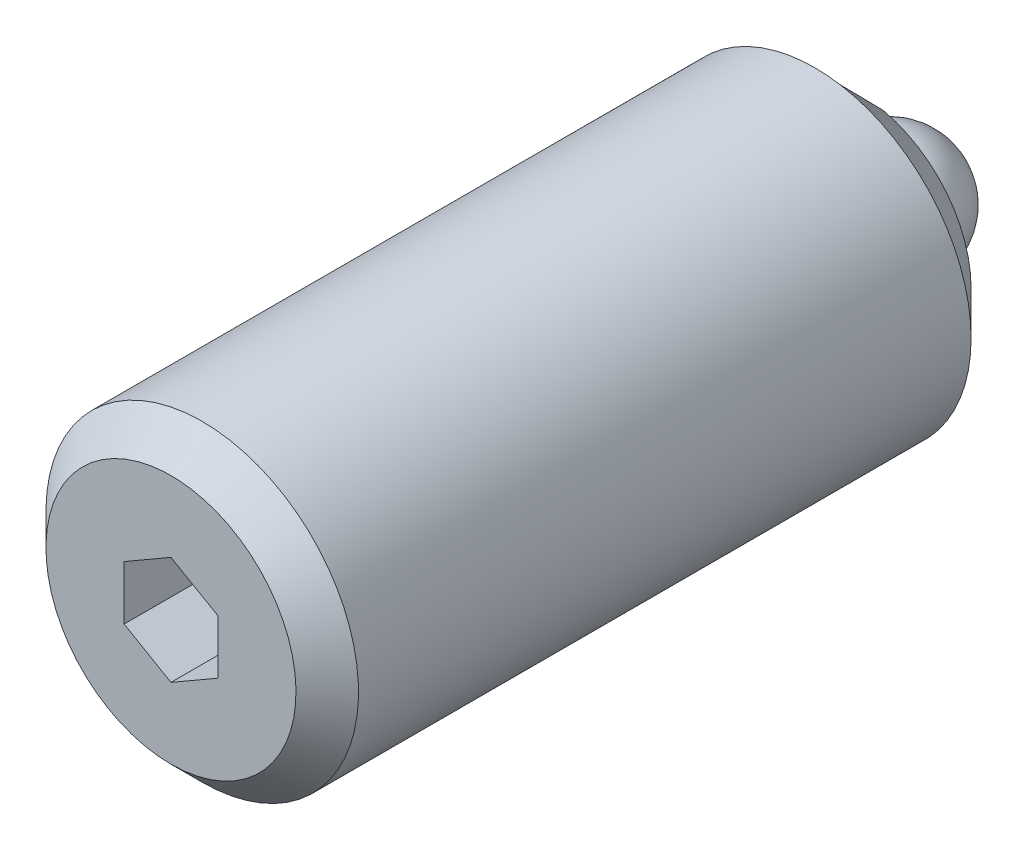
ISO-10303-21;
HEADER;
FILE_DESCRIPTION(('STEP AP214'),'2;1');
FILE_NAME('part.step','',(''),(''),'','','');
FILE_SCHEMA(('AUTOMOTIVE_DESIGN { 1 0 10303 214 1 1 1 1 }'));
ENDSEC;
DATA;
#1=APPLICATION_CONTEXT('core data for automotive mechanical design processes');
#2=APPLICATION_PROTOCOL_DEFINITION('international standard','automotive_design',2000,#1);
#3=PRODUCT_CONTEXT('',#1,'mechanical');
#4=PRODUCT('Part','Part','',(#3));
#5=PRODUCT_RELATED_PRODUCT_CATEGORY('part','',(#4));
#6=PRODUCT_DEFINITION_FORMATION('','',#4);
#7=PRODUCT_DEFINITION_CONTEXT('part definition',#1,'design');
#8=PRODUCT_DEFINITION('design','',#6,#7);
#9=PRODUCT_DEFINITION_SHAPE('','',#8);
#10=(LENGTH_UNIT() NAMED_UNIT(*) SI_UNIT(.MILLI.,.METRE.));
#11=(NAMED_UNIT(*) PLANE_ANGLE_UNIT() SI_UNIT($,.RADIAN.));
#12=(NAMED_UNIT(*) SI_UNIT($,.STERADIAN.) SOLID_ANGLE_UNIT());
#13=UNCERTAINTY_MEASURE_WITH_UNIT(LENGTH_MEASURE(1.E-05),#10,'distance_accuracy_value','');
#14=(GEOMETRIC_REPRESENTATION_CONTEXT(3) GLOBAL_UNCERTAINTY_ASSIGNED_CONTEXT((#13)) GLOBAL_UNIT_ASSIGNED_CONTEXT((#10,
#11,#12)) REPRESENTATION_CONTEXT('',''));
#15=CARTESIAN_POINT('',(0.,0.,0.));
#16=DIRECTION('',(0.,0.,1.));
#17=DIRECTION('',(1.,0.,0.));
#18=AXIS2_PLACEMENT_3D('',#15,#16,#17);
#19=CARTESIAN_POINT('',(0.,2.,3.));
#20=DIRECTION('',(0.,0.,-1.));
#21=DIRECTION('',(-1.,0.,0.));
#22=AXIS2_PLACEMENT_3D('',#19,#20,#21);
#23=PLANE('',#22);
#24=DIRECTION('',(0.,-1.,0.));
#25=VECTOR('',#24,1.);
#26=CARTESIAN_POINT('',(0.8,-1.83303027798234,3.));
#27=LINE('',#26,#25);
#28=CARTESIAN_POINT('',(0.8,-1.83303027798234,3.));
#29=VERTEX_POINT('',#28);
#30=CARTESIAN_POINT('',(0.8,-3.50998575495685,3.));
#31=VERTEX_POINT('',#30);
#32=EDGE_CURVE('E130',#29,#31,#27,.T.);
#33=ORIENTED_EDGE('',*,*,#32,.F.);
#34=CARTESIAN_POINT('',(0.,0.,3.));
#35=DIRECTION('',(0.,0.,-1.));
#36=DIRECTION('',(-1.,0.,0.));
#37=AXIS2_PLACEMENT_3D('',#34,#35,#36);
#38=CIRCLE('',#37,2.);
#39=CARTESIAN_POINT('',(0.8,1.83303027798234,3.));
#40=VERTEX_POINT('',#39);
#41=EDGE_CURVE('E219',#40,#29,#38,.T.);
#42=ORIENTED_EDGE('',*,*,#41,.F.);
#43=DIRECTION('',(0.,-1.,0.));
#44=VECTOR('',#43,1.);
#45=CARTESIAN_POINT('',(0.8,5.73576183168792,3.));
#46=LINE('',#45,#44);
#47=CARTESIAN_POINT('',(0.8,3.50998575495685,3.));
#48=VERTEX_POINT('',#47);
#49=EDGE_CURVE('E149',#48,#40,#46,.T.);
#50=ORIENTED_EDGE('',*,*,#49,.F.);
#51=CARTESIAN_POINT('',(0.,0.,3.));
#52=DIRECTION('',(0.,0.,-1.));
#53=DIRECTION('',(0.,1.,0.));
#54=AXIS2_PLACEMENT_3D('',#51,#52,#53);
#55=CIRCLE('',#54,3.6);
#56=EDGE_CURVE('E228',#48,#31,#55,.T.);
#57=ORIENTED_EDGE('',*,*,#56,.T.);
#58=EDGE_LOOP('',(#33,#42,#50,#57));
#59=FACE_BOUND('',#58,.T.);
#60=ADVANCED_FACE('F14',(#59),#23,.T.);
#61=CARTESIAN_POINT('',(0.,0.,3.));
#62=DIRECTION('',(0.,0.,1.));
#63=DIRECTION('',(0.,-1.,0.));
#64=AXIS2_PLACEMENT_3D('',#61,#62,#63);
#65=CONICAL_SURFACE('',#64,3.6,0.785398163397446);
#66=CARTESIAN_POINT('',(0.8,-0.477839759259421,0.331842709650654));
#67=CARTESIAN_POINT('',(0.8,-0.516722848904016,0.351829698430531));
#68=CARTESIAN_POINT('',(0.8,-0.554879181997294,0.373141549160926));
#69=CARTESIAN_POINT('',(0.8,-0.629938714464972,0.417786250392));
#70=CARTESIAN_POINT('',(0.8,-0.666843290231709,0.441116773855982));
#71=CARTESIAN_POINT('',(0.8,-0.739581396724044,0.489148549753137));
#72=CARTESIAN_POINT('',(0.8,-0.775417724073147,0.513845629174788));
#73=CARTESIAN_POINT('',(0.8,-0.846331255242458,0.564326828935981));
#74=CARTESIAN_POINT('',(0.8,-0.881408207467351,0.590111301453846));
#75=CARTESIAN_POINT('',(0.8,-0.985488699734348,0.668500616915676));
#76=CARTESIAN_POINT('',(0.8,-1.05358433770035,0.722306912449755));
#77=CARTESIAN_POINT('',(0.8,-1.18823427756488,0.831917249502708));
#78=CARTESIAN_POINT('',(0.8,-1.25478705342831,0.88772314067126));
#79=CARTESIAN_POINT('',(0.8,-1.38440784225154,0.998593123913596));
#80=CARTESIAN_POINT('',(0.8,-1.4475150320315,1.05361154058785));
#81=CARTESIAN_POINT('',(0.8,-1.57298591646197,1.16449114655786));
#82=CARTESIAN_POINT('',(0.8,-1.63534958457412,1.22035236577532));
#83=CARTESIAN_POINT('',(0.8,-1.82163611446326,1.38884930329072));
#84=CARTESIAN_POINT('',(0.8,-1.94474173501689,1.50238719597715));
#85=CARTESIAN_POINT('',(0.8,-2.18965919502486,1.73081379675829));
#86=CARTESIAN_POINT('',(0.8,-2.31147117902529,1.84570235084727));
#87=CARTESIAN_POINT('',(0.8,-2.55425975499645,2.07634192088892));
#88=CARTESIAN_POINT('',(0.8,-2.67523640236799,2.19209287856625));
#89=CARTESIAN_POINT('',(0.8,-2.91724218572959,2.4247633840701));
#90=CARTESIAN_POINT('',(0.8,-3.03826848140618,2.54168588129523));
#91=CARTESIAN_POINT('',(0.8,-3.27992198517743,2.77594641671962));
#92=CARTESIAN_POINT('',(0.8,-3.40054918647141,2.89328446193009));
#93=CARTESIAN_POINT('',(0.8,-3.76197810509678,3.24572467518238));
#94=CARTESIAN_POINT('',(0.8,-4.00234618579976,3.48127131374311));
#95=CARTESIAN_POINT('',(0.8,-4.54408556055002,4.01363388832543));
#96=CARTESIAN_POINT('',(0.8,-4.84526512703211,4.31064464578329));
#97=CARTESIAN_POINT('',(0.8,-5.44703511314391,4.90527798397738));
#98=CARTESIAN_POINT('',(0.8,-5.74762551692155,5.20290058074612));
#99=CARTESIAN_POINT('',(0.8,-6.34629390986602,5.79639805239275));
#100=CARTESIAN_POINT('',(0.8,-6.64437453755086,6.09227026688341));
#101=CARTESIAN_POINT('',(0.8,-7.24027299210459,6.68426138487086));
#102=CARTESIAN_POINT('',(0.8,-7.53809082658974,6.98038028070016));
#103=CARTESIAN_POINT('',(0.8,-7.83583794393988,7.2765700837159));
#104=B_SPLINE_CURVE_WITH_KNOTS('',3,(#66,#67,#68,#69,#70,#71,#72,#73,#74,#75,#76,#77,#78,#79,
#80,#81,#82,#83,#84,#85,#86,#87,#88,#89,#90,#91,#92,#93,#94,#95,#96,#97,#98,#99,#100,#101,#102,
#103),.UNSPECIFIED.,.F.,.F.,(4,2,2,2,2,2,2,2,2,2,2,2,2,2,2,2,2,2,4),(0.,0.13107351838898,
0.261997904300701,0.39254246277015,0.523129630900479,0.783424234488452,1.04396616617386,
1.29512415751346,1.54629108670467,2.04867569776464,2.55100357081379,3.05329780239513,
3.55813727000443,4.06298529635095,5.07260191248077,6.34158474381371,7.61060126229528,
8.87057404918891,10.1305090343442),.UNSPECIFIED.);
#105=CARTESIAN_POINT('',(0.8,-4.93558507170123,4.4));
#106=VERTEX_POINT('',#105);
#107=EDGE_CURVE('E9',#31,#106,#104,.T.);
#108=ORIENTED_EDGE('',*,*,#107,.F.);
#109=ORIENTED_EDGE('',*,*,#56,.F.);
#110=CARTESIAN_POINT('',(0.8,7.10763331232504,6.55251363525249));
#111=CARTESIAN_POINT('',(0.8,6.83583902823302,6.28244327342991));
#112=CARTESIAN_POINT('',(0.8,6.56396529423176,6.01245267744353));
#113=CARTESIAN_POINT('',(0.8,6.02002245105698,5.47284383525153));
#114=CARTESIAN_POINT('',(0.8,5.74795343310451,5.20322549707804));
#115=CARTESIAN_POINT('',(0.8,5.20364893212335,4.66463763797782));
#116=CARTESIAN_POINT('',(0.8,4.93141380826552,4.39566775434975));
#117=CARTESIAN_POINT('',(0.8,4.52252309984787,3.99267799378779));
#118=CARTESIAN_POINT('',(0.8,4.38611628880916,3.85840573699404));
#119=CARTESIAN_POINT('',(0.8,4.11307822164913,3.59008010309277));
#120=CARTESIAN_POINT('',(0.8,3.97644695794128,3.45602673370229));
#121=CARTESIAN_POINT('',(0.8,3.70263804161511,3.1879739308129));
#122=CARTESIAN_POINT('',(0.8,3.56545984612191,3.05397505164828));
#123=CARTESIAN_POINT('',(0.799999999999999,3.29071103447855,2.78641408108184));
#124=CARTESIAN_POINT('',(0.8,3.15314046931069,2.65285193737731));
#125=CARTESIAN_POINT('',(0.8,2.87754039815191,2.38646787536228));
#126=CARTESIAN_POINT('',(0.799999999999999,2.73951146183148,2.25364536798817));
#127=CARTESIAN_POINT('',(0.799999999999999,2.46250289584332,1.98886814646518));
#128=CARTESIAN_POINT('',(0.8,2.3235228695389,1.85691384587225));
#129=CARTESIAN_POINT('',(0.799999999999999,2.11372379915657,1.65992430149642));
#130=CARTESIAN_POINT('',(0.799999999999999,2.04345009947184,1.59430867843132));
#131=CARTESIAN_POINT('',(0.799999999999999,1.90242140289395,1.46361357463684));
#132=CARTESIAN_POINT('',(0.799999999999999,1.83166646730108,1.39853402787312));
#133=CARTESIAN_POINT('',(0.799999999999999,1.68960037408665,1.26919400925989));
#134=CARTESIAN_POINT('',(0.799999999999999,1.61829018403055,1.20493247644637));
#135=CARTESIAN_POINT('',(0.799999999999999,1.47471862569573,1.07740918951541));
#136=CARTESIAN_POINT('',(0.799999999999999,1.40245683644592,1.01414790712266));
#137=CARTESIAN_POINT('',(0.799999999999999,1.25622226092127,0.888846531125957));
#138=CARTESIAN_POINT('',(0.799999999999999,1.18224250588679,0.826814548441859));
#139=CARTESIAN_POINT('',(0.799999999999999,1.0323462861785,0.705291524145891));
#140=CARTESIAN_POINT('',(0.799999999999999,0.956432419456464,0.645797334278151));
#141=CARTESIAN_POINT('',(0.799999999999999,0.839905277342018,0.559640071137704));
#142=CARTESIAN_POINT('',(0.799999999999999,0.800497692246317,0.531354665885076));
#143=CARTESIAN_POINT('',(0.799999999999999,0.720646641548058,0.476331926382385));
#144=CARTESIAN_POINT('',(0.799999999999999,0.680203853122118,0.449593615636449));
#145=CARTESIAN_POINT('',(0.799999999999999,0.597770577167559,0.398141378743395));
#146=CARTESIAN_POINT('',(0.799999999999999,0.5557739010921,0.373437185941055));
#147=CARTESIAN_POINT('',(0.799999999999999,0.491450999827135,0.338722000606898));
#148=CARTESIAN_POINT('',(0.799999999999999,0.469764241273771,0.32752948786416));
#149=CARTESIAN_POINT('',(0.799999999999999,0.425905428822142,0.306107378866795));
#150=CARTESIAN_POINT('',(0.799999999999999,0.403733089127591,0.295878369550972));
#151=CARTESIAN_POINT('',(0.8,0.381302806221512,0.286223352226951));
#152=B_SPLINE_CURVE_WITH_KNOTS('',3,(#110,#111,#112,#113,#114,#115,#116,#117,#118,#119,#120,
#121,#122,#123,#124,#125,#126,#127,#128,#129,#130,#131,#132,#133,#134,#135,#136,#137,#138,#139,
#140,#141,#142,#143,#144,#145,#146,#147,#148,#149,#150,#151),.UNSPECIFIED.,.F.,.F.,(4,2,2,2,2,2,
2,2,2,2,2,2,2,2,2,2,2,2,2,2,4),(0.,1.14947448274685,2.29857845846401,3.44666768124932,
4.02088236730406,4.59511687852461,5.1704092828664,5.74563006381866,6.32029680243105,
6.89521990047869,7.18365212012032,7.4720482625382,7.76002158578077,8.04812689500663,
8.33773803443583,8.62697877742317,8.77247640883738,8.91788118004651,9.0639455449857,
9.1371381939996,9.21037514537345),.UNSPECIFIED.);
#153=CARTESIAN_POINT('',(0.8,4.93558507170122,4.4));
#154=VERTEX_POINT('',#153);
#155=EDGE_CURVE('E243',#154,#48,#152,.T.);
#156=ORIENTED_EDGE('',*,*,#155,.F.);
#157=CARTESIAN_POINT('',(0.,0.,4.4));
#158=DIRECTION('',(0.,0.,-1.));
#159=DIRECTION('',(0.,1.,0.));
#160=AXIS2_PLACEMENT_3D('',#157,#158,#159);
#161=CIRCLE('',#160,5.);
#162=EDGE_CURVE('E236',#106,#154,#161,.F.);
#163=ORIENTED_EDGE('',*,*,#162,.F.);
#164=EDGE_LOOP('',(#108,#109,#156,#163));
#165=FACE_BOUND('',#164,.T.);
#166=ADVANCED_FACE('F304',(#165),#65,.T.);
#167=CARTESIAN_POINT('',(0.,5.,25.));
#168=DIRECTION('',(0.,0.,1.));
#169=DIRECTION('',(1.,0.,0.));
#170=AXIS2_PLACEMENT_3D('',#167,#168,#169);
#171=PLANE('',#170);
#172=CARTESIAN_POINT('',(0.,0.,25.));
#173=DIRECTION('',(0.,0.,1.));
#174=DIRECTION('',(0.,-1.,0.));
#175=AXIS2_PLACEMENT_3D('',#172,#173,#174);
#176=CIRCLE('',#175,4.);
#177=CARTESIAN_POINT('',(0.,-3.99999999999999,25.));
#178=VERTEX_POINT('',#177);
#179=EDGE_CURVE('E224',#178,#178,#176,.T.);
#180=ORIENTED_EDGE('',*,*,#179,.T.);
#181=EDGE_LOOP('',(#180));
#182=FACE_BOUND('',#181,.T.);
#183=DIRECTION('',(0.866025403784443,-0.499999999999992,0.));
#184=VECTOR('',#183,1.);
#185=CARTESIAN_POINT('',(-1.5,-0.866025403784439,25.));
#186=LINE('',#185,#184);
#187=CARTESIAN_POINT('',(-1.5,-0.86602540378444,25.));
#188=VERTEX_POINT('',#187);
#189=CARTESIAN_POINT('',(0.,-1.73205080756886,25.));
#190=VERTEX_POINT('',#189);
#191=EDGE_CURVE('E181',#188,#190,#186,.T.);
#192=ORIENTED_EDGE('',*,*,#191,.F.);
#193=DIRECTION('',(0.,1.,0.));
#194=VECTOR('',#193,1.);
#195=CARTESIAN_POINT('',(-1.5,-0.866025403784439,25.));
#196=LINE('',#195,#194);
#197=CARTESIAN_POINT('',(-1.5,0.866025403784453,25.));
#198=VERTEX_POINT('',#197);
#199=EDGE_CURVE('E164',#188,#198,#196,.T.);
#200=ORIENTED_EDGE('',*,*,#199,.T.);
#201=DIRECTION('',(0.866025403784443,0.499999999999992,0.));
#202=VECTOR('',#201,1.);
#203=CARTESIAN_POINT('',(-1.5,0.866025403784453,25.));
#204=LINE('',#203,#202);
#205=CARTESIAN_POINT('',(0.,1.73205080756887,25.));
#206=VERTEX_POINT('',#205);
#207=EDGE_CURVE('E169',#198,#206,#204,.T.);
#208=ORIENTED_EDGE('',*,*,#207,.T.);
#209=DIRECTION('',(-0.866025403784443,0.499999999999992,0.));
#210=VECTOR('',#209,1.);
#211=CARTESIAN_POINT('',(1.5,0.866025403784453,25.));
#212=LINE('',#211,#210);
#213=CARTESIAN_POINT('',(1.5,0.866025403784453,25.));
#214=VERTEX_POINT('',#213);
#215=EDGE_CURVE('E172',#214,#206,#212,.T.);
#216=ORIENTED_EDGE('',*,*,#215,.F.);
#217=DIRECTION('',(0.,1.,0.));
#218=VECTOR('',#217,1.);
#219=CARTESIAN_POINT('',(1.5,-0.866025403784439,25.));
#220=LINE('',#219,#218);
#221=CARTESIAN_POINT('',(1.5,-0.866025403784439,25.));
#222=VERTEX_POINT('',#221);
#223=EDGE_CURVE('E175',#222,#214,#220,.T.);
#224=ORIENTED_EDGE('',*,*,#223,.F.);
#225=DIRECTION('',(-0.866025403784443,-0.499999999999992,0.));
#226=VECTOR('',#225,1.);
#227=CARTESIAN_POINT('',(1.5,-0.866025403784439,25.));
#228=LINE('',#227,#226);
#229=EDGE_CURVE('E178',#222,#190,#228,.T.);
#230=ORIENTED_EDGE('',*,*,#229,.T.);
#231=EDGE_LOOP('',(#192,#200,#208,#216,#224,#230));
#232=FACE_BOUND('',#231,.T.);
#233=ADVANCED_FACE('F301',(#182,#232),#171,.T.);
#234=CARTESIAN_POINT('',(0.,0.,2.));
#235=DIRECTION('',(-1.,0.,0.));
#236=DIRECTION('',(0.,0.,1.));
#237=AXIS2_PLACEMENT_3D('',#234,#235,#236);
#238=SPHERICAL_SURFACE('',#237,2.);
#239=CARTESIAN_POINT('',(0.,0.,2.));
#240=DIRECTION('',(0.,0.,-1.));
#241=DIRECTION('',(-1.,0.,0.));
#242=AXIS2_PLACEMENT_3D('',#239,#240,#241);
#243=SPHERICAL_SURFACE('',#242,2.);
#244=CARTESIAN_POINT('',(0.,0.,2.));
#245=DIRECTION('',(0.,0.,-1.));
#246=DIRECTION('',(-1.,0.,0.));
#247=AXIS2_PLACEMENT_3D('',#244,#245,#246);
#248=CIRCLE('',#247,2.);
#249=CARTESIAN_POINT('',(-2.,0.,2.));
#250=VERTEX_POINT('',#249);
#251=EDGE_CURVE('E215',#250,#250,#248,.T.);
#252=ORIENTED_EDGE('',*,*,#251,.T.);
#253=EDGE_LOOP('',(#252));
#254=FACE_BOUND('',#253,.T.);
#255=ADVANCED_FACE('F299',(#254),#243,.T.);
#256=CARTESIAN_POINT('',(0.,0.,-1.));
#257=DIRECTION('',(0.,0.,-1.));
#258=DIRECTION('',(-1.,0.,0.));
#259=AXIS2_PLACEMENT_3D('',#256,#257,#258);
#260=CYLINDRICAL_SURFACE('',#259,5.);
#261=CARTESIAN_POINT('',(-0.8,4.93558507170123,4.4));
#262=VERTEX_POINT('',#261);
#263=CARTESIAN_POINT('',(-0.8,-4.93558507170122,4.4));
#264=VERTEX_POINT('',#263);
#265=EDGE_CURVE('E232',#262,#264,#161,.F.);
#266=ORIENTED_EDGE('',*,*,#265,.T.);
#267=EDGE_CURVE('E127',#264,#106,#161,.F.);
#268=ORIENTED_EDGE('',*,*,#267,.T.);
#269=ORIENTED_EDGE('',*,*,#162,.T.);
#270=EDGE_CURVE('E231',#154,#262,#161,.F.);
#271=ORIENTED_EDGE('',*,*,#270,.T.);
#272=EDGE_LOOP('',(#266,#268,#269,#271));
#273=FACE_BOUND('',#272,.T.);
#274=CARTESIAN_POINT('',(0.,0.,24.));
#275=DIRECTION('',(0.,0.,1.));
#276=DIRECTION('',(0.,-1.,0.));
#277=AXIS2_PLACEMENT_3D('',#274,#275,#276);
#278=CIRCLE('',#277,5.);
#279=CARTESIAN_POINT('',(0.,-4.99999999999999,24.));
#280=VERTEX_POINT('',#279);
#281=EDGE_CURVE('E221',#280,#280,#278,.F.);
#282=ORIENTED_EDGE('',*,*,#281,.T.);
#283=EDGE_LOOP('',(#282));
#284=FACE_BOUND('',#283,.T.);
#285=ADVANCED_FACE('F295',(#273,#284),#260,.T.);
#286=DIRECTION('',(0.,1.,0.));
#287=VECTOR('',#286,1.);
#288=CARTESIAN_POINT('',(-0.8,-1.83303027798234,3.));
#289=LINE('',#288,#287);
#290=CARTESIAN_POINT('',(-0.8,-3.50998575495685,3.));
#291=VERTEX_POINT('',#290);
#292=CARTESIAN_POINT('',(-0.8,-1.83303027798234,3.));
#293=VERTEX_POINT('',#292);
#294=EDGE_CURVE('E136',#291,#293,#289,.T.);
#295=ORIENTED_EDGE('',*,*,#294,.F.);
#296=CARTESIAN_POINT('',(-0.8,3.50998575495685,3.));
#297=VERTEX_POINT('',#296);
#298=EDGE_CURVE('E227',#291,#297,#55,.T.);
#299=ORIENTED_EDGE('',*,*,#298,.T.);
#300=DIRECTION('',(0.,1.,0.));
#301=VECTOR('',#300,1.);
#302=CARTESIAN_POINT('',(-0.8,5.73576183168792,3.));
#303=LINE('',#302,#301);
#304=CARTESIAN_POINT('',(-0.8,1.83303027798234,3.));
#305=VERTEX_POINT('',#304);
#306=EDGE_CURVE('E154',#305,#297,#303,.T.);
#307=ORIENTED_EDGE('',*,*,#306,.F.);
#308=EDGE_CURVE('E218',#293,#305,#38,.T.);
#309=ORIENTED_EDGE('',*,*,#308,.F.);
#310=EDGE_LOOP('',(#295,#299,#307,#309));
#311=FACE_BOUND('',#310,.T.);
#312=ADVANCED_FACE('F292',(#311),#23,.T.);
#313=CARTESIAN_POINT('',(0.,0.,-1.));
#314=DIRECTION('',(0.,0.,-1.));
#315=DIRECTION('',(-1.,0.,0.));
#316=AXIS2_PLACEMENT_3D('',#313,#314,#315);
#317=CYLINDRICAL_SURFACE('',#316,2.);
#318=ORIENTED_EDGE('',*,*,#41,.T.);
#319=DIRECTION('',(0.,0.,-1.));
#320=VECTOR('',#319,1.);
#321=CARTESIAN_POINT('',(0.8,-1.83303027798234,4.4));
#322=LINE('',#321,#320);
#323=CARTESIAN_POINT('',(0.8,-1.83303027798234,4.4));
#324=VERTEX_POINT('',#323);
#325=EDGE_CURVE('E139',#324,#29,#322,.T.);
#326=ORIENTED_EDGE('',*,*,#325,.F.);
#327=CARTESIAN_POINT('',(0.,0.,4.4));
#328=DIRECTION('',(0.,0.,1.));
#329=DIRECTION('',(0.,1.,0.));
#330=AXIS2_PLACEMENT_3D('',#327,#328,#329);
#331=CIRCLE('',#330,2.);
#332=CARTESIAN_POINT('',(-0.8,-1.83303027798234,4.4));
#333=VERTEX_POINT('',#332);
#334=EDGE_CURVE('E125',#333,#324,#331,.T.);
#335=ORIENTED_EDGE('',*,*,#334,.F.);
#336=DIRECTION('',(0.,0.,-1.));
#337=VECTOR('',#336,1.);
#338=CARTESIAN_POINT('',(-0.8,-1.83303027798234,4.4));
#339=LINE('',#338,#337);
#340=EDGE_CURVE('E133',#333,#293,#339,.T.);
#341=ORIENTED_EDGE('',*,*,#340,.T.);
#342=ORIENTED_EDGE('',*,*,#308,.T.);
#343=DIRECTION('',(0.,0.,-1.));
#344=VECTOR('',#343,1.);
#345=CARTESIAN_POINT('',(-0.8,1.83303027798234,4.4));
#346=LINE('',#345,#344);
#347=CARTESIAN_POINT('',(-0.8,1.83303027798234,4.4));
#348=VERTEX_POINT('',#347);
#349=EDGE_CURVE('E161',#348,#305,#346,.T.);
#350=ORIENTED_EDGE('',*,*,#349,.F.);
#351=CARTESIAN_POINT('',(0.,0.,4.4));
#352=DIRECTION('',(0.,0.,1.));
#353=DIRECTION('',(0.,1.,0.));
#354=AXIS2_PLACEMENT_3D('',#351,#352,#353);
#355=CIRCLE('',#354,2.);
#356=CARTESIAN_POINT('',(0.8,1.83303027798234,4.4));
#357=VERTEX_POINT('',#356);
#358=EDGE_CURVE('E153',#357,#348,#355,.T.);
#359=ORIENTED_EDGE('',*,*,#358,.F.);
#360=DIRECTION('',(0.,0.,-1.));
#361=VECTOR('',#360,1.);
#362=CARTESIAN_POINT('',(0.8,1.83303027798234,4.4));
#363=LINE('',#362,#361);
#364=EDGE_CURVE('E157',#357,#40,#363,.T.);
#365=ORIENTED_EDGE('',*,*,#364,.T.);
#366=EDGE_LOOP('',(#318,#326,#335,#341,#342,#350,#359,#365));
#367=FACE_BOUND('',#366,.T.);
#368=ORIENTED_EDGE('',*,*,#251,.F.);
#369=EDGE_LOOP('',(#368));
#370=FACE_BOUND('',#369,.T.);
#371=ADVANCED_FACE('F142',(#367,#370),#317,.T.);
#372=CARTESIAN_POINT('',(-1.5,-0.86602540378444,21.5));
#373=DIRECTION('',(1.,0.,0.));
#374=DIRECTION('',(0.,0.,-1.));
#375=AXIS2_PLACEMENT_3D('',#372,#373,#374);
#376=PLANE('',#375);
#377=DIRECTION('',(0.,0.,1.));
#378=VECTOR('',#377,1.);
#379=CARTESIAN_POINT('',(-1.5,0.866025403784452,21.5));
#380=LINE('',#379,#378);
#381=CARTESIAN_POINT('',(-1.5,0.866025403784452,21.5));
#382=VERTEX_POINT('',#381);
#383=EDGE_CURVE('E213',#382,#198,#380,.T.);
#384=ORIENTED_EDGE('',*,*,#383,.T.);
#385=ORIENTED_EDGE('',*,*,#199,.F.);
#386=DIRECTION('',(0.,0.,1.));
#387=VECTOR('',#386,1.);
#388=CARTESIAN_POINT('',(-1.5,-0.86602540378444,21.5));
#389=LINE('',#388,#387);
#390=CARTESIAN_POINT('',(-1.5,-0.86602540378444,21.5));
#391=VERTEX_POINT('',#390);
#392=EDGE_CURVE('E202',#391,#188,#389,.T.);
#393=ORIENTED_EDGE('',*,*,#392,.F.);
#394=DIRECTION('',(0.,1.,0.));
#395=VECTOR('',#394,1.);
#396=CARTESIAN_POINT('',(-1.5,-0.86602540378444,21.5));
#397=LINE('',#396,#395);
#398=EDGE_CURVE('E184',#391,#382,#397,.T.);
#399=ORIENTED_EDGE('',*,*,#398,.T.);
#400=EDGE_LOOP('',(#384,#385,#393,#399));
#401=FACE_BOUND('',#400,.T.);
#402=ADVANCED_FACE('F268',(#401),#376,.T.);
#403=CARTESIAN_POINT('',(-1.5,0.866025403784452,21.5));
#404=DIRECTION('',(0.499999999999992,-0.866025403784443,0.));
#405=DIRECTION('',(0.866025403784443,0.499999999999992,0.));
#406=AXIS2_PLACEMENT_3D('',#403,#404,#405);
#407=PLANE('',#406);
#408=DIRECTION('',(0.,0.,1.));
#409=VECTOR('',#408,1.);
#410=CARTESIAN_POINT('',(0.,1.73205080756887,21.5));
#411=LINE('',#410,#409);
#412=CARTESIAN_POINT('',(0.,1.73205080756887,21.5));
#413=VERTEX_POINT('',#412);
#414=EDGE_CURVE('E211',#413,#206,#411,.T.);
#415=ORIENTED_EDGE('',*,*,#414,.T.);
#416=ORIENTED_EDGE('',*,*,#207,.F.);
#417=ORIENTED_EDGE('',*,*,#383,.F.);
#418=DIRECTION('',(0.866025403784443,0.499999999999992,0.));
#419=VECTOR('',#418,1.);
#420=CARTESIAN_POINT('',(-1.5,0.866025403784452,21.5));
#421=LINE('',#420,#419);
#422=EDGE_CURVE('E187',#382,#413,#421,.T.);
#423=ORIENTED_EDGE('',*,*,#422,.T.);
#424=EDGE_LOOP('',(#415,#416,#417,#423));
#425=FACE_BOUND('',#424,.T.);
#426=ADVANCED_FACE('F271',(#425),#407,.T.);
#427=CARTESIAN_POINT('',(1.5,0.866025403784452,21.5));
#428=DIRECTION('',(0.499999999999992,0.866025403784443,0.));
#429=DIRECTION('',(-0.866025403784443,0.499999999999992,0.));
#430=AXIS2_PLACEMENT_3D('',#427,#428,#429);
#431=PLANE('',#430);
#432=DIRECTION('',(0.,0.,1.));
#433=VECTOR('',#432,1.);
#434=CARTESIAN_POINT('',(1.5,0.866025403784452,21.5));
#435=LINE('',#434,#433);
#436=CARTESIAN_POINT('',(1.5,0.866025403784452,21.5));
#437=VERTEX_POINT('',#436);
#438=EDGE_CURVE('E209',#437,#214,#435,.T.);
#439=ORIENTED_EDGE('',*,*,#438,.T.);
#440=ORIENTED_EDGE('',*,*,#215,.T.);
#441=ORIENTED_EDGE('',*,*,#414,.F.);
#442=DIRECTION('',(-0.866025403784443,0.499999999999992,0.));
#443=VECTOR('',#442,1.);
#444=CARTESIAN_POINT('',(1.5,0.866025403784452,21.5));
#445=LINE('',#444,#443);
#446=EDGE_CURVE('E190',#437,#413,#445,.T.);
#447=ORIENTED_EDGE('',*,*,#446,.F.);
#448=EDGE_LOOP('',(#439,#440,#441,#447));
#449=FACE_BOUND('',#448,.T.);
#450=ADVANCED_FACE('F282',(#449),#431,.F.);
#451=CARTESIAN_POINT('',(1.5,-0.86602540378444,21.5));
#452=DIRECTION('',(1.,0.,0.));
#453=DIRECTION('',(0.,0.,-1.));
#454=AXIS2_PLACEMENT_3D('',#451,#452,#453);
#455=PLANE('',#454);
#456=DIRECTION('',(0.,0.,1.));
#457=VECTOR('',#456,1.);
#458=CARTESIAN_POINT('',(1.5,-0.86602540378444,21.5));
#459=LINE('',#458,#457);
#460=CARTESIAN_POINT('',(1.5,-0.86602540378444,21.5));
#461=VERTEX_POINT('',#460);
#462=EDGE_CURVE('E207',#461,#222,#459,.T.);
#463=ORIENTED_EDGE('',*,*,#462,.T.);
#464=ORIENTED_EDGE('',*,*,#223,.T.);
#465=ORIENTED_EDGE('',*,*,#438,.F.);
#466=DIRECTION('',(0.,1.,0.));
#467=VECTOR('',#466,1.);
#468=CARTESIAN_POINT('',(1.5,-0.86602540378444,21.5));
#469=LINE('',#468,#467);
#470=EDGE_CURVE('E193',#461,#437,#469,.T.);
#471=ORIENTED_EDGE('',*,*,#470,.F.);
#472=EDGE_LOOP('',(#463,#464,#465,#471));
#473=FACE_BOUND('',#472,.T.);
#474=ADVANCED_FACE('F278',(#473),#455,.F.);
#475=CARTESIAN_POINT('',(1.5,-0.86602540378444,21.5));
#476=DIRECTION('',(-0.499999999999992,0.866025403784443,0.));
#477=DIRECTION('',(-0.866025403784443,-0.499999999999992,0.));
#478=AXIS2_PLACEMENT_3D('',#475,#476,#477);
#479=PLANE('',#478);
#480=DIRECTION('',(0.,0.,1.));
#481=VECTOR('',#480,1.);
#482=CARTESIAN_POINT('',(0.,-1.73205080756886,21.5));
#483=LINE('',#482,#481);
#484=CARTESIAN_POINT('',(0.,-1.73205080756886,21.5));
#485=VERTEX_POINT('',#484);
#486=EDGE_CURVE('E205',#485,#190,#483,.T.);
#487=ORIENTED_EDGE('',*,*,#486,.T.);
#488=ORIENTED_EDGE('',*,*,#229,.F.);
#489=ORIENTED_EDGE('',*,*,#462,.F.);
#490=DIRECTION('',(-0.866025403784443,-0.499999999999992,0.));
#491=VECTOR('',#490,1.);
#492=CARTESIAN_POINT('',(1.5,-0.86602540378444,21.5));
#493=LINE('',#492,#491);
#494=EDGE_CURVE('E196',#461,#485,#493,.T.);
#495=ORIENTED_EDGE('',*,*,#494,.T.);
#496=EDGE_LOOP('',(#487,#488,#489,#495));
#497=FACE_BOUND('',#496,.T.);
#498=ADVANCED_FACE('F267',(#497),#479,.T.);
#499=CARTESIAN_POINT('',(-1.5,-0.86602540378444,21.5));
#500=DIRECTION('',(-0.499999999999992,-0.866025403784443,0.));
#501=DIRECTION('',(0.866025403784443,-0.499999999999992,0.));
#502=AXIS2_PLACEMENT_3D('',#499,#500,#501);
#503=PLANE('',#502);
#504=DIRECTION('',(0.866025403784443,-0.499999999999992,0.));
#505=VECTOR('',#504,1.);
#506=CARTESIAN_POINT('',(-1.5,-0.86602540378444,21.5));
#507=LINE('',#506,#505);
#508=EDGE_CURVE('E199',#391,#485,#507,.T.);
#509=ORIENTED_EDGE('',*,*,#508,.F.);
#510=ORIENTED_EDGE('',*,*,#392,.T.);
#511=ORIENTED_EDGE('',*,*,#191,.T.);
#512=ORIENTED_EDGE('',*,*,#486,.F.);
#513=EDGE_LOOP('',(#509,#510,#511,#512));
#514=FACE_BOUND('',#513,.T.);
#515=ADVANCED_FACE('F265',(#514),#503,.F.);
#516=CARTESIAN_POINT('',(-1.5,2.59807621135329,21.5));
#517=DIRECTION('',(0.,0.,1.));
#518=DIRECTION('',(1.,0.,0.));
#519=AXIS2_PLACEMENT_3D('',#516,#517,#518);
#520=PLANE('',#519);
#521=ORIENTED_EDGE('',*,*,#398,.F.);
#522=ORIENTED_EDGE('',*,*,#508,.T.);
#523=ORIENTED_EDGE('',*,*,#494,.F.);
#524=ORIENTED_EDGE('',*,*,#470,.T.);
#525=ORIENTED_EDGE('',*,*,#446,.T.);
#526=ORIENTED_EDGE('',*,*,#422,.F.);
#527=EDGE_LOOP('',(#521,#522,#523,#524,#525,#526));
#528=FACE_BOUND('',#527,.T.);
#529=ADVANCED_FACE('F261',(#528),#520,.T.);
#530=CARTESIAN_POINT('',(0.,0.,24.));
#531=DIRECTION('',(0.,0.,-1.));
#532=DIRECTION('',(0.,1.,0.));
#533=AXIS2_PLACEMENT_3D('',#530,#531,#532);
#534=CONICAL_SURFACE('',#533,5.,0.785398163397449);
#535=ORIENTED_EDGE('',*,*,#179,.F.);
#536=EDGE_LOOP('',(#535));
#537=FACE_BOUND('',#536,.T.);
#538=ORIENTED_EDGE('',*,*,#281,.F.);
#539=EDGE_LOOP('',(#538));
#540=FACE_BOUND('',#539,.T.);
#541=ADVANCED_FACE('F264',(#537,#540),#534,.T.);
#542=CARTESIAN_POINT('',(-0.8,-7.83583794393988,7.2765700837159));
#543=CARTESIAN_POINT('',(-0.800000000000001,-7.53689782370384,6.97919256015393));
#544=CARTESIAN_POINT('',(-0.800000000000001,-7.23788569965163,6.68188727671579));
#545=CARTESIAN_POINT('',(-0.800000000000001,-6.6396691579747,6.08759835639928));
#546=CARTESIAN_POINT('',(-0.800000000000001,-6.34046479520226,5.79061466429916));
#547=CARTESIAN_POINT('',(-0.800000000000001,-5.7418633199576,5.19719287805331));
#548=CARTESIAN_POINT('',(-0.800000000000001,-5.44246642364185,4.90075456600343));
#549=CARTESIAN_POINT('',(-0.800000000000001,-4.99289081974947,4.45652412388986));
#550=CARTESIAN_POINT('',(-0.800000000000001,-4.84293747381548,4.30850394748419));
#551=CARTESIAN_POINT('',(-0.8,-4.54282837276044,4.01266197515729));
#552=CARTESIAN_POINT('',(-0.8,-4.39267261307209,3.8648401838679));
#553=CARTESIAN_POINT('',(-0.8,-4.09191148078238,3.56928786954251));
#554=CARTESIAN_POINT('',(-0.8,-3.94130578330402,3.42155767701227));
#555=CARTESIAN_POINT('',(-0.800000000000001,-3.63973667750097,3.12648754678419));
#556=CARTESIAN_POINT('',(-0.8,-3.48877329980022,2.97914757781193));
#557=CARTESIAN_POINT('',(-0.8,-3.18640837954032,2.68511133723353));
#558=CARTESIAN_POINT('',(-0.8,-3.03500717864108,2.53841471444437));
#559=CARTESIAN_POINT('',(-0.8,-2.73135603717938,2.24580994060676));
#560=CARTESIAN_POINT('',(-0.8,-2.57910585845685,2.09990203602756));
#561=CARTESIAN_POINT('',(-0.8,-2.34957062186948,1.88191801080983));
#562=CARTESIAN_POINT('',(-0.8,-2.2727791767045,1.80932242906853));
#563=CARTESIAN_POINT('',(-0.8,-2.11876046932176,1.66460744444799));
#564=CARTESIAN_POINT('',(-0.8,-2.04153324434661,1.59248800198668));
#565=CARTESIAN_POINT('',(-0.8,-1.88655786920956,1.44896219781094));
#566=CARTESIAN_POINT('',(-0.8,-1.80881029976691,1.37755520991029));
#567=CARTESIAN_POINT('',(-0.8,-1.65246005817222,1.23563144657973));
#568=CARTESIAN_POINT('',(-0.8,-1.57385713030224,1.1651149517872));
#569=CARTESIAN_POINT('',(-0.8,-1.41516891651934,1.02520607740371));
#570=CARTESIAN_POINT('',(-0.8,-1.33507943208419,0.955818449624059));
#571=CARTESIAN_POINT('',(-0.8,-1.17312456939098,0.819259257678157));
#572=CARTESIAN_POINT('',(-0.8,-1.09126077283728,0.752085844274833));
#573=CARTESIAN_POINT('',(-0.8,-0.96606021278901,0.654037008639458));
#574=CARTESIAN_POINT('',(-0.8,-0.923838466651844,0.621743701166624));
#575=CARTESIAN_POINT('',(-0.8,-0.838423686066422,0.558501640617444));
#576=CARTESIAN_POINT('',(-0.8,-0.795231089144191,0.527552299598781));
#577=CARTESIAN_POINT('',(-0.8,-0.707414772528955,0.467429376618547));
#578=CARTESIAN_POINT('',(-0.8,-0.662787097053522,0.438261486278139));
#579=CARTESIAN_POINT('',(-0.8,-0.594536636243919,0.396569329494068));
#580=CARTESIAN_POINT('',(-0.8,-0.571550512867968,0.383005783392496));
#581=CARTESIAN_POINT('',(-0.8,-0.525081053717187,0.356736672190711));
#582=CARTESIAN_POINT('',(-0.8,-0.501597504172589,0.344031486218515));
#583=CARTESIAN_POINT('',(-0.8,-0.477839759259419,0.331842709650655));
#584=B_SPLINE_CURVE_WITH_KNOTS('',3,(#542,#543,#544,#545,#546,#547,#548,#549,#550,#551,#552,
#553,#554,#555,#556,#557,#558,#559,#560,#561,#562,#563,#564,#565,#566,#567,#568,#569,#570,#571,
#572,#573,#574,#575,#576,#577,#578,#579,#580,#581,#582,#583),.UNSPECIFIED.,.F.,.F.,(4,2,2,2,2,2,
2,2,2,2,2,2,2,2,2,2,2,2,2,2,4),(0.,1.26498521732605,2.52969969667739,3.79367198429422,
4.42578244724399,5.05790742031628,5.69080238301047,6.32364498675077,6.95608317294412,
7.58870872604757,7.90573007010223,8.22272471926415,8.53941058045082,8.85619387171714,
9.17407680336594,9.49168715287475,9.65113544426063,9.81051326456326,9.97037618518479,
10.0504283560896,10.1305156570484),.UNSPECIFIED.);
#585=EDGE_CURVE('E28',#264,#291,#584,.T.);
#586=ORIENTED_EDGE('',*,*,#585,.F.);
#587=ORIENTED_EDGE('',*,*,#265,.F.);
#588=CARTESIAN_POINT('',(-0.8,0.381302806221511,0.286223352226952));
#589=CARTESIAN_POINT('',(-0.8,0.412427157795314,0.299634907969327));
#590=CARTESIAN_POINT('',(-0.8,0.443053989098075,0.314128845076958));
#591=CARTESIAN_POINT('',(-0.8,0.50339062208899,0.344837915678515));
#592=CARTESIAN_POINT('',(-0.8,0.533101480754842,0.361050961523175));
#593=CARTESIAN_POINT('',(-0.8,0.591649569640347,0.394726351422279));
#594=CARTESIAN_POINT('',(-0.8,0.620489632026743,0.4121838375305));
#595=CARTESIAN_POINT('',(-0.8,0.677534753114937,0.448123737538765));
#596=CARTESIAN_POINT('',(-0.8,0.705739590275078,0.466606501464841));
#597=CARTESIAN_POINT('',(-0.8,0.78925476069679,0.523047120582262));
#598=CARTESIAN_POINT('',(-0.800000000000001,0.84376983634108,0.562178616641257));
#599=CARTESIAN_POINT('',(-0.8,0.951346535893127,0.64249242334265));
#600=CARTESIAN_POINT('',(-0.8,1.00440632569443,0.683677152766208));
#601=CARTESIAN_POINT('',(-0.8,1.10867558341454,0.76681618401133));
#602=CARTESIAN_POINT('',(-0.8,1.15990067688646,0.80875096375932));
#603=CARTESIAN_POINT('',(-0.8,1.26155986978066,0.893570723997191));
#604=CARTESIAN_POINT('',(-0.8,1.31199391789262,0.936455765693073));
#605=CARTESIAN_POINT('',(-0.8,1.4624267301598,1.06615841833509));
#606=CARTESIAN_POINT('',(-0.8,1.56153526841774,1.15400651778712));
#607=CARTESIAN_POINT('',(-0.8,1.7583227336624,1.33129634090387));
#608=CARTESIAN_POINT('',(-0.8,1.85600151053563,1.42073822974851));
#609=CARTESIAN_POINT('',(-0.8,2.05039967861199,1.6006324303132));
#610=CARTESIAN_POINT('',(-0.8,2.14711919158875,1.69108461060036));
#611=CARTESIAN_POINT('',(-0.8,2.34042408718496,1.8731618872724));
#612=CARTESIAN_POINT('',(-0.8,2.43700599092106,1.96479066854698));
#613=CARTESIAN_POINT('',(-0.8,2.62970203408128,2.14854446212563));
#614=CARTESIAN_POINT('',(-0.8,2.72581615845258,2.24066949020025));
#615=CARTESIAN_POINT('',(-0.8,3.01360572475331,2.51753907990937));
#616=CARTESIAN_POINT('',(-0.8,3.20476854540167,2.70281623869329));
#617=CARTESIAN_POINT('',(-0.8,3.4697175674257,2.9607111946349));
#618=CARTESIAN_POINT('',(-0.8,3.54384209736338,3.03298260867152));
#619=CARTESIAN_POINT('',(-0.8,3.69188121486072,3.17752964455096));
#620=CARTESIAN_POINT('',(-0.8,3.76579595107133,3.24980511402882));
#621=CARTESIAN_POINT('',(-0.8,4.11240900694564,3.58912683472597));
#622=CARTESIAN_POINT('',(-0.8,4.38457433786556,3.85671737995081));
#623=CARTESIAN_POINT('',(-0.8,4.92825657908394,4.39255876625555));
#624=CARTESIAN_POINT('',(-0.8,5.19977348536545,4.66080961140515));
#625=CARTESIAN_POINT('',(-0.8,5.74417329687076,5.19947840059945));
#626=CARTESIAN_POINT('',(-0.8,6.01705352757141,5.46989904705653));
#627=CARTESIAN_POINT('',(-0.8,6.56252638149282,6.01102484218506));
#628=CARTESIAN_POINT('',(-0.8,6.83511900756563,6.28172998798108));
#629=CARTESIAN_POINT('',(-0.8,7.10763331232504,6.55251363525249));
#630=B_SPLINE_CURVE_WITH_KNOTS('',3,(#588,#589,#590,#591,#592,#593,#594,#595,#596,#597,#598,
#599,#600,#601,#602,#603,#604,#605,#606,#607,#608,#609,#610,#611,#612,#613,#614,#615,#616,#617,
#618,#619,#620,#621,#622,#623,#624,#625,#626,#627,#628,#629),.UNSPECIFIED.,.F.,.F.,(4,2,2,2,2,2,
2,2,2,2,2,2,2,2,2,2,2,2,2,2,4),(0.,0.101610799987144,0.203099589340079,0.30421186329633,
0.405358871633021,0.606592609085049,0.808069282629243,1.00665498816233,1.20525352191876,
1.60253143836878,1.99985077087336,2.39711900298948,2.79651021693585,3.19591419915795,
3.99455605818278,4.30513368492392,4.61526931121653,5.76030305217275,6.90534386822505,
8.05787060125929,9.21038579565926),.UNSPECIFIED.);
#631=EDGE_CURVE('E235',#297,#262,#630,.T.);
#632=ORIENTED_EDGE('',*,*,#631,.F.);
#633=ORIENTED_EDGE('',*,*,#298,.F.);
#634=EDGE_LOOP('',(#586,#587,#632,#633));
#635=FACE_BOUND('',#634,.T.);
#636=ADVANCED_FACE('F16',(#635),#65,.T.);
#637=CARTESIAN_POINT('',(0.8,5.73576183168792,4.4));
#638=DIRECTION('',(1.,0.,0.));
#639=DIRECTION('',(0.,1.,0.));
#640=AXIS2_PLACEMENT_3D('',#637,#638,#639);
#641=PLANE('',#640);
#642=ORIENTED_EDGE('',*,*,#155,.T.);
#643=ORIENTED_EDGE('',*,*,#49,.T.);
#644=ORIENTED_EDGE('',*,*,#364,.F.);
#645=DIRECTION('',(0.,-1.,0.));
#646=VECTOR('',#645,1.);
#647=CARTESIAN_POINT('',(0.8,5.73576183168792,4.4));
#648=LINE('',#647,#646);
#649=EDGE_CURVE('E151',#154,#357,#648,.T.);
#650=ORIENTED_EDGE('',*,*,#649,.F.);
#651=EDGE_LOOP('',(#642,#643,#644,#650));
#652=FACE_BOUND('',#651,.T.);
#653=ADVANCED_FACE('F254',(#652),#641,.F.);
#654=CARTESIAN_POINT('',(-0.8,5.73576183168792,4.4));
#655=DIRECTION('',(-1.,0.,0.));
#656=DIRECTION('',(0.,-1.,0.));
#657=AXIS2_PLACEMENT_3D('',#654,#655,#656);
#658=PLANE('',#657);
#659=ORIENTED_EDGE('',*,*,#631,.T.);
#660=DIRECTION('',(0.,1.,0.));
#661=VECTOR('',#660,1.);
#662=CARTESIAN_POINT('',(-0.8,5.73576183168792,4.4));
#663=LINE('',#662,#661);
#664=EDGE_CURVE('E42',#348,#262,#663,.T.);
#665=ORIENTED_EDGE('',*,*,#664,.F.);
#666=ORIENTED_EDGE('',*,*,#349,.T.);
#667=ORIENTED_EDGE('',*,*,#306,.T.);
#668=EDGE_LOOP('',(#659,#665,#666,#667));
#669=FACE_BOUND('',#668,.T.);
#670=ADVANCED_FACE('F249',(#669),#658,.F.);
#671=CARTESIAN_POINT('',(0.,0.,4.4));
#672=DIRECTION('',(0.,0.,-1.));
#673=DIRECTION('',(0.,1.,0.));
#674=AXIS2_PLACEMENT_3D('',#671,#672,#673);
#675=PLANE('',#674);
#676=ORIENTED_EDGE('',*,*,#649,.T.);
#677=ORIENTED_EDGE('',*,*,#358,.T.);
#678=ORIENTED_EDGE('',*,*,#664,.T.);
#679=ORIENTED_EDGE('',*,*,#270,.F.);
#680=EDGE_LOOP('',(#676,#677,#678,#679));
#681=FACE_BOUND('',#680,.T.);
#682=ADVANCED_FACE('F253',(#681),#675,.T.);
#683=CARTESIAN_POINT('',(0.8,-1.83303027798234,4.4));
#684=DIRECTION('',(1.,0.,0.));
#685=DIRECTION('',(0.,1.,0.));
#686=AXIS2_PLACEMENT_3D('',#683,#684,#685);
#687=PLANE('',#686);
#688=ORIENTED_EDGE('',*,*,#107,.T.);
#689=DIRECTION('',(0.,-1.,0.));
#690=VECTOR('',#689,1.);
#691=CARTESIAN_POINT('',(0.8,-1.83303027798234,4.4));
#692=LINE('',#691,#690);
#693=EDGE_CURVE('E35',#324,#106,#692,.T.);
#694=ORIENTED_EDGE('',*,*,#693,.F.);
#695=ORIENTED_EDGE('',*,*,#325,.T.);
#696=ORIENTED_EDGE('',*,*,#32,.T.);
#697=EDGE_LOOP('',(#688,#694,#695,#696));
#698=FACE_BOUND('',#697,.T.);
#699=ADVANCED_FACE('F336',(#698),#687,.F.);
#700=CARTESIAN_POINT('',(-0.8,-1.83303027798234,4.4));
#701=DIRECTION('',(-1.,0.,0.));
#702=DIRECTION('',(0.,-1.,0.));
#703=AXIS2_PLACEMENT_3D('',#700,#701,#702);
#704=PLANE('',#703);
#705=ORIENTED_EDGE('',*,*,#585,.T.);
#706=ORIENTED_EDGE('',*,*,#294,.T.);
#707=ORIENTED_EDGE('',*,*,#340,.F.);
#708=DIRECTION('',(0.,1.,0.));
#709=VECTOR('',#708,1.);
#710=CARTESIAN_POINT('',(-0.8,-1.83303027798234,4.4));
#711=LINE('',#710,#709);
#712=EDGE_CURVE('E121',#264,#333,#711,.T.);
#713=ORIENTED_EDGE('',*,*,#712,.F.);
#714=EDGE_LOOP('',(#705,#706,#707,#713));
#715=FACE_BOUND('',#714,.T.);
#716=ADVANCED_FACE('F134',(#715),#704,.F.);
#717=CARTESIAN_POINT('',(0.,0.,4.4));
#718=DIRECTION('',(0.,0.,-1.));
#719=DIRECTION('',(0.,1.,0.));
#720=AXIS2_PLACEMENT_3D('',#717,#718,#719);
#721=PLANE('',#720);
#722=ORIENTED_EDGE('',*,*,#712,.T.);
#723=ORIENTED_EDGE('',*,*,#334,.T.);
#724=ORIENTED_EDGE('',*,*,#693,.T.);
#725=ORIENTED_EDGE('',*,*,#267,.F.);
#726=EDGE_LOOP('',(#722,#723,#724,#725));
#727=FACE_BOUND('',#726,.T.);
#728=ADVANCED_FACE('F123',(#727),#721,.T.);
#729=CLOSED_SHELL('',(#60,#166,#233,#255,#285,#312,#371,#402,#426,#450,#474,#498,#515,#529,#541,
#636,#653,#670,#682,#699,#716,#728));
#730=MANIFOLD_SOLID_BREP('B1',#729);
#731=ADVANCED_BREP_SHAPE_REPRESENTATION('',(#18,#730),#14);
#732=SHAPE_DEFINITION_REPRESENTATION(#9,#731);
ENDSEC;
END-ISO-10303-21;
